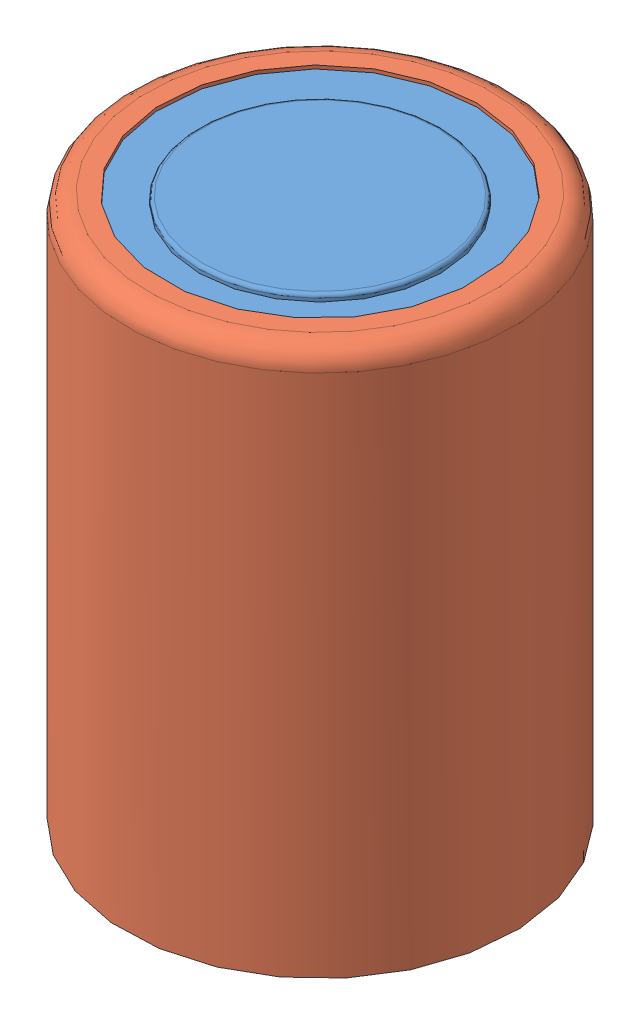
SolidWorks assembly 2-batterie.SLDASM, configuration Défaut (file format 3100). Lengths in mm.
Overall size (15.55 15.8 15.55).
4 component instances, 2 part files, 6 mates.
Components (placement in the parent):
- 2-Pile-2: 2-Pile.SLDPRT [Défaut] at (0 -5.2 0) size (11 5.2 11)
- 2-Pile-3: 2-Pile.SLDPRT [Défaut] at (0 -10.4 0) x (0.723383 0 0.690447) z (-0.690447 0 0.723383) size (11 5.2 11)
- 2-Pile-4: 2-Pile.SLDPRT [Défaut] at (0 -15.6 0) size (11 5.2 11)
- 2-enveloppePiles-1: 2-enveloppePiles.SLDPRT [Défaut] x (0.921651 0 -0.388019) z (0.388019 0 0.921651) size (11.2 15.8 11.2)
Mates (geometry in assembly coordinates):
- Coïncidente4: coincident aligned: line of 2-Pile-2; line of 2-Pile-3
- Coïncidente5: coincident aligned: line of 2-Pile-2; line of 2-Pile-4
- Coïncidente6: coincident: point of 2-Pile-2; point of 2-Pile-3
- Coïncidente7: coincident: point of 2-Pile-3; point of 2-Pile-4
- Coaxiale1: concentric aligned: cylinder of 2-Pile-4; cylinder of 2-enveloppePiles-1
- Coïncidente8: coincident: point of 2-enveloppePiles-1; point of assembly
